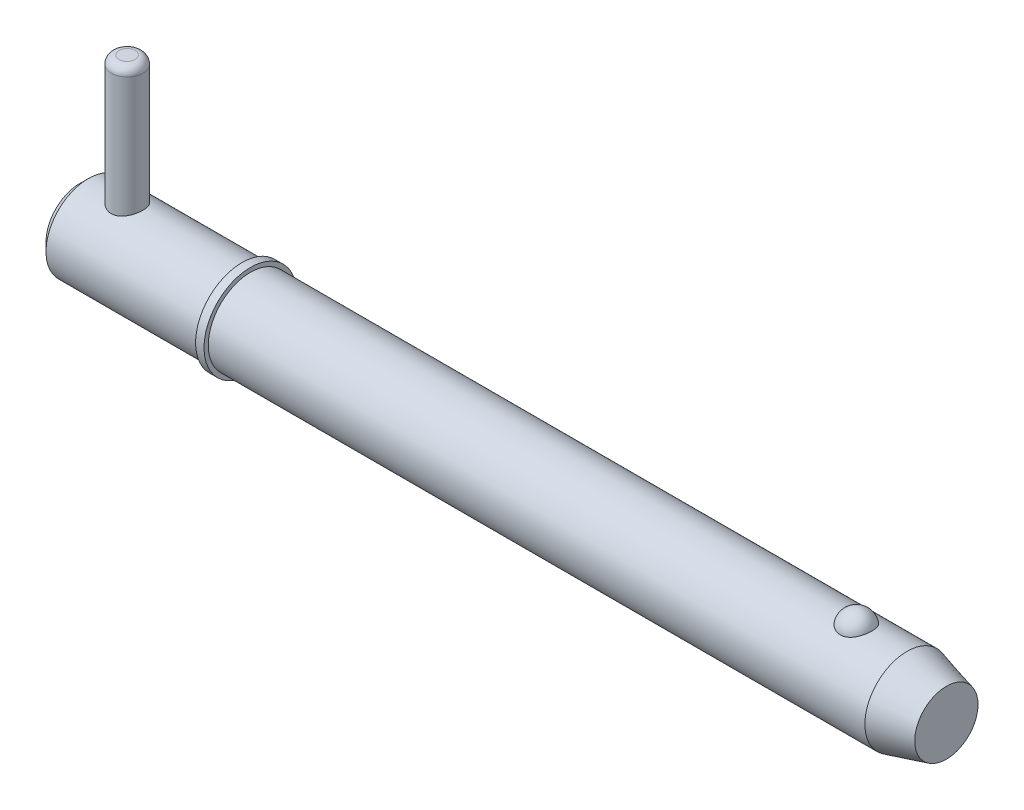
ISO-10303-21;
HEADER;
FILE_DESCRIPTION(('STEP AP214'),'2;1');
FILE_NAME('part.step','',(''),(''),'','','');
FILE_SCHEMA(('AUTOMOTIVE_DESIGN { 1 0 10303 214 1 1 1 1 }'));
ENDSEC;
DATA;
#1=APPLICATION_CONTEXT('core data for automotive mechanical design processes');
#2=APPLICATION_PROTOCOL_DEFINITION('international standard','automotive_design',2000,#1);
#3=PRODUCT_CONTEXT('',#1,'mechanical');
#4=PRODUCT('Part','Part','',(#3));
#5=PRODUCT_RELATED_PRODUCT_CATEGORY('part','',(#4));
#6=PRODUCT_DEFINITION_FORMATION('','',#4);
#7=PRODUCT_DEFINITION_CONTEXT('part definition',#1,'design');
#8=PRODUCT_DEFINITION('design','',#6,#7);
#9=PRODUCT_DEFINITION_SHAPE('','',#8);
#10=(LENGTH_UNIT() NAMED_UNIT(*) SI_UNIT(.MILLI.,.METRE.));
#11=(NAMED_UNIT(*) PLANE_ANGLE_UNIT() SI_UNIT($,.RADIAN.));
#12=(NAMED_UNIT(*) SI_UNIT($,.STERADIAN.) SOLID_ANGLE_UNIT());
#13=UNCERTAINTY_MEASURE_WITH_UNIT(LENGTH_MEASURE(1.E-05),#10,'distance_accuracy_value','');
#14=(GEOMETRIC_REPRESENTATION_CONTEXT(3) GLOBAL_UNCERTAINTY_ASSIGNED_CONTEXT((#13)) GLOBAL_UNIT_ASSIGNED_CONTEXT((#10,
#11,#12)) REPRESENTATION_CONTEXT('',''));
#15=CARTESIAN_POINT('',(0.,0.,0.));
#16=DIRECTION('',(0.,0.,1.));
#17=DIRECTION('',(1.,0.,0.));
#18=AXIS2_PLACEMENT_3D('',#15,#16,#17);
#19=CARTESIAN_POINT('',(7.14,25.4,0.));
#20=DIRECTION('',(0.,-1.,0.));
#21=DIRECTION('',(0.,0.,-1.));
#22=AXIS2_PLACEMENT_3D('',#19,#20,#21);
#23=CYLINDRICAL_SURFACE('',#22,2.38);
#24=CARTESIAN_POINT('',(7.14,-5.16,0.));
#25=DIRECTION('',(0.,1.,0.));
#26=DIRECTION('',(0.,0.,1.));
#27=AXIS2_PLACEMENT_3D('',#24,#25,#26);
#28=CIRCLE('',#27,2.38);
#29=CARTESIAN_POINT('',(7.14,-5.16,2.38));
#30=VERTEX_POINT('',#29);
#31=EDGE_CURVE('P0_E24',#30,#30,#28,.T.);
#32=ORIENTED_EDGE('',*,*,#31,.T.);
#33=EDGE_LOOP('',(#32));
#34=FACE_BOUND('',#33,.T.);
#35=CARTESIAN_POINT('',(7.14,24.21,0.));
#36=DIRECTION('',(0.,1.,0.));
#37=DIRECTION('',(0.,0.,1.));
#38=AXIS2_PLACEMENT_3D('',#35,#36,#37);
#39=CIRCLE('',#38,2.38);
#40=CARTESIAN_POINT('',(7.14,24.21,2.38));
#41=VERTEX_POINT('',#40);
#42=EDGE_CURVE('P0_E28',#41,#41,#39,.F.);
#43=ORIENTED_EDGE('',*,*,#42,.T.);
#44=EDGE_LOOP('',(#43));
#45=FACE_BOUND('',#44,.T.);
#46=ADVANCED_FACE('P0_F13',(#34,#45),#23,.T.);
#47=CARTESIAN_POINT('',(7.14,25.4,0.));
#48=DIRECTION('',(0.,1.,0.));
#49=DIRECTION('',(0.,0.,1.));
#50=AXIS2_PLACEMENT_3D('',#47,#48,#49);
#51=PLANE('',#50);
#52=CARTESIAN_POINT('',(7.14,25.4,0.));
#53=DIRECTION('',(0.,1.,0.));
#54=DIRECTION('',(0.,0.,1.));
#55=AXIS2_PLACEMENT_3D('',#52,#53,#54);
#56=CIRCLE('',#55,1.19);
#57=CARTESIAN_POINT('',(7.14,25.4,1.19));
#58=VERTEX_POINT('',#57);
#59=EDGE_CURVE('P0_E9',#58,#58,#56,.T.);
#60=ORIENTED_EDGE('',*,*,#59,.T.);
#61=EDGE_LOOP('',(#60));
#62=FACE_BOUND('',#61,.T.);
#63=ADVANCED_FACE('P0_F45',(#62),#51,.T.);
#64=CARTESIAN_POINT('',(7.14,-6.35,0.));
#65=DIRECTION('',(0.,1.,0.));
#66=DIRECTION('',(0.,0.,1.));
#67=AXIS2_PLACEMENT_3D('',#64,#65,#66);
#68=PLANE('',#67);
#69=CARTESIAN_POINT('',(7.14,-6.35,0.));
#70=DIRECTION('',(0.,1.,0.));
#71=DIRECTION('',(0.,0.,1.));
#72=AXIS2_PLACEMENT_3D('',#69,#70,#71);
#73=CIRCLE('',#72,1.19);
#74=CARTESIAN_POINT('',(7.14,-6.35,1.19));
#75=VERTEX_POINT('',#74);
#76=EDGE_CURVE('P0_E20',#75,#75,#73,.F.);
#77=ORIENTED_EDGE('',*,*,#76,.T.);
#78=EDGE_LOOP('',(#77));
#79=FACE_BOUND('',#78,.T.);
#80=ADVANCED_FACE('P0_F42',(#79),#68,.F.);
#81=CARTESIAN_POINT('',(7.14,-5.16,0.));
#82=DIRECTION('',(0.,1.,0.));
#83=DIRECTION('',(0.,0.,1.));
#84=AXIS2_PLACEMENT_3D('',#81,#82,#83);
#85=DEGENERATE_TOROIDAL_SURFACE('',#84,1.19,1.19,.T.);
#86=ORIENTED_EDGE('',*,*,#76,.F.);
#87=EDGE_LOOP('',(#86));
#88=FACE_BOUND('',#87,.T.);
#89=ORIENTED_EDGE('',*,*,#31,.F.);
#90=EDGE_LOOP('',(#89));
#91=FACE_BOUND('',#90,.T.);
#92=ADVANCED_FACE('P0_F37',(#88,#91),#85,.T.);
#93=CARTESIAN_POINT('',(7.14,24.21,0.));
#94=DIRECTION('',(0.,1.,0.));
#95=DIRECTION('',(0.,0.,1.));
#96=AXIS2_PLACEMENT_3D('',#93,#94,#95);
#97=DEGENERATE_TOROIDAL_SURFACE('',#96,1.19,1.19,.T.);
#98=ORIENTED_EDGE('',*,*,#42,.F.);
#99=EDGE_LOOP('',(#98));
#100=FACE_BOUND('',#99,.T.);
#101=ORIENTED_EDGE('',*,*,#59,.F.);
#102=EDGE_LOOP('',(#101));
#103=FACE_BOUND('',#102,.T.);
#104=ADVANCED_FACE('P0_F15',(#100,#103),#97,.T.);
#105=CLOSED_SHELL('',(#46,#63,#80,#92,#104));
#106=MANIFOLD_SOLID_BREP('P0_B1',#105);
#107=CARTESIAN_POINT('',(0.,0.,0.));
#108=DIRECTION('',(1.,0.,0.));
#109=DIRECTION('',(0.,0.,-1.));
#110=AXIS2_PLACEMENT_3D('',#107,#108,#109);
#111=CYLINDRICAL_SURFACE('',#110,6.35);
#112=CARTESIAN_POINT('',(124.555369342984,0.,0.));
#113=DIRECTION('',(1.,0.,0.));
#114=DIRECTION('',(0.,0.,-1.));
#115=AXIS2_PLACEMENT_3D('',#112,#113,#114);
#116=CIRCLE('',#115,6.35);
#117=CARTESIAN_POINT('',(124.555369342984,0.,-6.35));
#118=VERTEX_POINT('',#117);
#119=EDGE_CURVE('P1_E81',#118,#118,#116,.T.);
#120=ORIENTED_EDGE('',*,*,#119,.F.);
#121=EDGE_LOOP('',(#120));
#122=FACE_BOUND('',#121,.T.);
#123=CARTESIAN_POINT('',(25.7,0.,0.));
#124=DIRECTION('',(1.,0.,0.));
#125=DIRECTION('',(0.,0.,-1.));
#126=AXIS2_PLACEMENT_3D('',#123,#124,#125);
#127=CIRCLE('',#126,6.35);
#128=CARTESIAN_POINT('',(25.7,0.,-6.35));
#129=VERTEX_POINT('',#128);
#130=EDGE_CURVE('P1_E85',#129,#129,#127,.T.);
#131=ORIENTED_EDGE('',*,*,#130,.T.);
#132=EDGE_LOOP('',(#131));
#133=FACE_BOUND('',#132,.T.);
#134=CARTESIAN_POINT('',(116.930021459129,5.87502187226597,2.40969251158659));
#135=CARTESIAN_POINT('',(116.805030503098,5.87501645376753,2.40969773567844));
#136=CARTESIAN_POINT('',(116.680080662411,5.87916061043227,2.39967292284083));
#137=CARTESIAN_POINT('',(116.433909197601,5.8952311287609,2.35991730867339));
#138=CARTESIAN_POINT('',(116.312686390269,5.90715499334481,2.33019283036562));
#139=CARTESIAN_POINT('',(116.077517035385,5.93739567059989,2.25201402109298));
#140=CARTESIAN_POINT('',(115.963560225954,5.95570321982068,2.2035868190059));
#141=CARTESIAN_POINT('',(115.74557352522,5.99672067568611,2.08937987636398));
#142=CARTESIAN_POINT('',(115.641545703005,6.01943149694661,2.02359652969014));
#143=CARTESIAN_POINT('',(115.442943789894,6.06760647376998,1.87428969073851));
#144=CARTESIAN_POINT('',(115.348726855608,6.09313095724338,1.79031110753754));
#145=CARTESIAN_POINT('',(115.175255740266,6.14375873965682,1.60800178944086));
#146=CARTESIAN_POINT('',(115.096004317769,6.16886196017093,1.50966841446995));
#147=CARTESIAN_POINT('',(114.950845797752,6.21724600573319,1.29645884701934));
#148=CARTESIAN_POINT('',(114.885688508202,6.24039621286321,1.18104158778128));
#149=CARTESIAN_POINT('',(114.774703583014,6.28117277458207,0.940351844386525));
#150=CARTESIAN_POINT('',(114.728877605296,6.29879865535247,0.815078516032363));
#151=CARTESIAN_POINT('',(114.657023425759,6.32692073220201,0.556494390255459));
#152=CARTESIAN_POINT('',(114.631249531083,6.33732517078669,0.423102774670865));
#153=CARTESIAN_POINT('',(114.600988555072,6.34957673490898,0.153542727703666));
#154=CARTESIAN_POINT('',(114.596500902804,6.35142408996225,0.0173743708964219));
#155=CARTESIAN_POINT('',(114.608865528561,6.34638925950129,-0.253036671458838));
#156=CARTESIAN_POINT('',(114.625594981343,6.33955731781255,-0.387285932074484));
#157=CARTESIAN_POINT('',(114.679843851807,6.31794129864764,-0.650851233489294));
#158=CARTESIAN_POINT('',(114.717363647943,6.30315707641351,-0.780167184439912));
#159=CARTESIAN_POINT('',(114.812500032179,6.26711642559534,-1.03041949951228));
#160=CARTESIAN_POINT('',(114.870143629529,6.24585130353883,-1.15134433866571));
#161=CARTESIAN_POINT('',(115.004352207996,6.19905619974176,-1.38129800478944));
#162=CARTESIAN_POINT('',(115.080918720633,6.17352587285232,-1.49032586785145));
#163=CARTESIAN_POINT('',(115.251753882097,6.12080227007,-1.69393164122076));
#164=CARTESIAN_POINT('',(115.346100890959,6.09360200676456,-1.78844209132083));
#165=CARTESIAN_POINT('',(115.550119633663,6.04070434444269,-1.95970536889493));
#166=CARTESIAN_POINT('',(115.659790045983,6.01500681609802,-2.03645972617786));
#167=CARTESIAN_POINT('',(115.889187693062,5.96867714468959,-2.1684564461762));
#168=CARTESIAN_POINT('',(116.008652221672,5.94794910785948,-2.22412062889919));
#169=CARTESIAN_POINT('',(116.256218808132,5.91340580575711,-2.31440992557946));
#170=CARTESIAN_POINT('',(116.384317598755,5.89958794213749,-2.3490429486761));
#171=CARTESIAN_POINT('',(116.638582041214,5.88111049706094,-2.39491590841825));
#172=CARTESIAN_POINT('',(116.764520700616,5.876025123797,-2.40724512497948));
#173=CARTESIAN_POINT('',(117.016786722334,5.87428980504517,-2.41147867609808));
#174=CARTESIAN_POINT('',(117.143114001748,5.87763817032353,-2.40338710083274));
#175=CARTESIAN_POINT('',(117.388417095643,5.89212921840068,-2.36762715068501));
#176=CARTESIAN_POINT('',(117.507499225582,5.90302431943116,-2.34058030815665));
#177=CARTESIAN_POINT('',(117.73924472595,5.93113752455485,-2.26839066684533));
#178=CARTESIAN_POINT('',(117.851907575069,5.94835614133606,-2.2232464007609));
#179=CARTESIAN_POINT('',(118.070400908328,5.98773016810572,-2.11493806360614));
#180=CARTESIAN_POINT('',(118.176028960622,6.00998499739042,-2.05140269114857));
#181=CARTESIAN_POINT('',(118.375300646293,6.05690144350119,-1.90842705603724));
#182=CARTESIAN_POINT('',(118.468941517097,6.08156361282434,-1.82898313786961));
#183=CARTESIAN_POINT('',(118.646675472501,6.13211715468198,-1.65182429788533));
#184=CARTESIAN_POINT('',(118.730055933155,6.15800825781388,-1.55339381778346));
#185=CARTESIAN_POINT('',(118.879790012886,6.20712834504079,-1.34374214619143));
#186=CARTESIAN_POINT('',(118.946140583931,6.23035685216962,-1.23251867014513));
#187=CARTESIAN_POINT('',(119.062345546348,6.27251177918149,-0.996447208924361));
#188=CARTESIAN_POINT('',(119.111607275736,6.29127762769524,-0.871278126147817));
#189=CARTESIAN_POINT('',(119.189614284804,6.3215862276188,-0.613870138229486));
#190=CARTESIAN_POINT('',(119.218359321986,6.33312889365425,-0.481631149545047));
#191=CARTESIAN_POINT('',(119.25477058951,6.34782349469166,-0.213672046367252));
#192=CARTESIAN_POINT('',(119.262413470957,6.35096613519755,-0.0779482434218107));
#193=CARTESIAN_POINT('',(119.256395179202,6.34851322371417,0.19294395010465));
#194=CARTESIAN_POINT('',(119.242734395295,6.3429178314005,0.32811235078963));
#195=CARTESIAN_POINT('',(119.19450361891,6.32360512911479,0.593406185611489));
#196=CARTESIAN_POINT('',(119.160031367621,6.30992579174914,0.723552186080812));
#197=CARTESIAN_POINT('',(119.070953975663,6.27586325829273,0.975834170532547));
#198=CARTESIAN_POINT('',(119.01634761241,6.25547965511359,1.09796966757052));
#199=CARTESIAN_POINT('',(118.88775879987,6.20998183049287,1.33148921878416));
#200=CARTESIAN_POINT('',(118.813674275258,6.18484288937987,1.44281227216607));
#201=CARTESIAN_POINT('',(118.647820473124,6.13258735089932,1.65087683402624));
#202=CARTESIAN_POINT('',(118.556051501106,6.10547078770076,1.74761859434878));
#203=CARTESIAN_POINT('',(118.357183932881,6.0523587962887,1.92350926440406));
#204=CARTESIAN_POINT('',(118.250133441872,6.0263601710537,2.00271146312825));
#205=CARTESIAN_POINT('',(118.023138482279,5.97843747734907,2.14154159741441));
#206=CARTESIAN_POINT('',(117.903191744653,5.95651412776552,2.20116608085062));
#207=CARTESIAN_POINT('',(117.644523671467,5.91812106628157,2.30250570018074));
#208=CARTESIAN_POINT('',(117.50506980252,5.90217533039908,2.34256795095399));
#209=CARTESIAN_POINT('',(117.220397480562,5.88063128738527,2.39615214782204));
#210=CARTESIAN_POINT('',(117.07518174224,5.8750281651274,2.40968644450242));
#211=CARTESIAN_POINT('',(116.930021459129,5.87502187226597,2.40969251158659));
#212=B_SPLINE_CURVE_WITH_KNOTS('',3,(#134,#135,#136,#137,#138,#139,#140,#141,#142,#143,#144,
#145,#146,#147,#148,#149,#150,#151,#152,#153,#154,#155,#156,#157,#158,#159,#160,#161,#162,#163,
#164,#165,#166,#167,#168,#169,#170,#171,#172,#173,#174,#175,#176,#177,#178,#179,#180,#181,#182,
#183,#184,#185,#186,#187,#188,#189,#190,#191,#192,#193,#194,#195,#196,#197,#198,#199,#200,#201,
#202,#203,#204,#205,#206,#207,#208,#209,#210,#211),.UNSPECIFIED.,.T.,.F.,(4,2,2,2,2,2,2,2,2,2,2,
2,2,2,2,2,2,2,2,2,2,2,2,2,2,2,2,2,2,2,2,2,2,2,2,2,2,2,4),(0.,0.374440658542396,
0.748761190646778,1.12254078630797,1.49639810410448,1.88098871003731,2.26565013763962,
2.66741104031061,3.06920639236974,3.47601794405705,3.88281858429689,4.28727498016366,
4.69173873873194,5.09674745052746,5.50178895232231,5.90865911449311,6.31549420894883,
6.71369855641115,7.11175305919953,7.48978077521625,7.86773278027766,8.2338388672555,
8.59997464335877,8.97409044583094,9.34829231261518,9.74122667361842,10.1342313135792,
10.5397522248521,10.9452779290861,11.3512521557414,11.7572189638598,12.1612938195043,
12.5653932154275,12.9716540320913,13.3779078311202,13.7829098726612,14.1879832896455,
14.6230486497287,15.0579114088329),.UNSPECIFIED.);
#213=CARTESIAN_POINT('',(116.930021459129,5.87502187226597,2.40969251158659));
#214=VERTEX_POINT('',#213);
#215=EDGE_CURVE('P1_E35',#214,#214,#212,.T.);
#216=ORIENTED_EDGE('',*,*,#215,.T.);
#217=EDGE_LOOP('',(#216));
#218=FACE_BOUND('',#217,.T.);
#219=ADVANCED_FACE('P1_F13',(#122,#133,#218),#111,.T.);
#220=CARTESIAN_POINT('',(0.,0.,0.));
#221=DIRECTION('',(-1.,0.,0.));
#222=DIRECTION('',(0.,0.,1.));
#223=AXIS2_PLACEMENT_3D('',#220,#221,#222);
#224=PLANE('',#223);
#225=CARTESIAN_POINT('',(0.,0.,0.));
#226=DIRECTION('',(1.,0.,0.));
#227=DIRECTION('',(0.,0.,-1.));
#228=AXIS2_PLACEMENT_3D('',#225,#226,#227);
#229=CIRCLE('',#228,5.08);
#230=CARTESIAN_POINT('',(0.,0.,-5.08));
#231=VERTEX_POINT('',#230);
#232=EDGE_CURVE('P1_E9',#231,#231,#229,.T.);
#233=ORIENTED_EDGE('',*,*,#232,.F.);
#234=EDGE_LOOP('',(#233));
#235=FACE_BOUND('',#234,.T.);
#236=ADVANCED_FACE('P1_F15',(#235),#224,.T.);
#237=CARTESIAN_POINT('',(1.27,0.,0.));
#238=DIRECTION('',(1.,0.,0.));
#239=DIRECTION('',(0.,0.,-1.));
#240=AXIS2_PLACEMENT_3D('',#237,#238,#239);
#241=CONICAL_SURFACE('',#240,6.35,0.78539816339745);
#242=ORIENTED_EDGE('',*,*,#232,.T.);
#243=EDGE_LOOP('',(#242));
#244=FACE_BOUND('',#243,.T.);
#245=CARTESIAN_POINT('',(1.27,0.,0.));
#246=DIRECTION('',(1.,0.,0.));
#247=DIRECTION('',(0.,0.,-1.));
#248=AXIS2_PLACEMENT_3D('',#245,#246,#247);
#249=CIRCLE('',#248,6.35);
#250=CARTESIAN_POINT('',(1.27,0.,-6.35));
#251=VERTEX_POINT('',#250);
#252=EDGE_CURVE('P1_E26',#251,#251,#249,.T.);
#253=ORIENTED_EDGE('',*,*,#252,.F.);
#254=EDGE_LOOP('',(#253));
#255=FACE_BOUND('',#254,.T.);
#256=ADVANCED_FACE('P1_F77',(#244,#255),#241,.T.);
#257=CARTESIAN_POINT('',(0.,0.,0.));
#258=DIRECTION('',(1.,0.,0.));
#259=DIRECTION('',(0.,0.,-1.));
#260=AXIS2_PLACEMENT_3D('',#257,#258,#259);
#261=CYLINDRICAL_SURFACE('',#260,6.35);
#262=CARTESIAN_POINT('',(7.14,-5.88711304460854,2.38));
#263=CARTESIAN_POINT('',(7.01146258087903,-5.88710856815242,2.38000480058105));
#264=CARTESIAN_POINT('',(6.88295682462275,-5.89136840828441,2.36955244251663));
#265=CARTESIAN_POINT('',(6.62981934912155,-5.90782785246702,2.32820953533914));
#266=CARTESIAN_POINT('',(6.50518751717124,-5.92002722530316,2.29731958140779));
#267=CARTESIAN_POINT('',(6.26352403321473,-5.95079384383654,2.21639366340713));
#268=CARTESIAN_POINT('',(6.14647496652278,-5.96934583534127,2.16640353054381));
#269=CARTESIAN_POINT('',(5.92237941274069,-6.01070278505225,2.04885862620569));
#270=CARTESIAN_POINT('',(5.81533593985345,-6.03350901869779,1.98129858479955));
#271=CARTESIAN_POINT('',(5.60897525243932,-6.08207341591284,1.82693902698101));
#272=CARTESIAN_POINT('',(5.51022503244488,-6.10791836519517,1.73940861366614));
#273=CARTESIAN_POINT('',(5.32840561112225,-6.15892405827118,1.54914379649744));
#274=CARTESIAN_POINT('',(5.24533975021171,-6.1840846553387,1.44640616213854));
#275=CARTESIAN_POINT('',(5.09451639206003,-6.23191821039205,1.22434014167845));
#276=CARTESIAN_POINT('',(5.02737511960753,-6.25447755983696,1.10456656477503));
#277=CARTESIAN_POINT('',(4.91443001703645,-6.2935236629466,0.854429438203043));
#278=CARTESIAN_POINT('',(4.86861879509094,-6.31001251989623,0.724069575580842));
#279=CARTESIAN_POINT('',(4.80162253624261,-6.33444370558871,0.46242122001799));
#280=CARTESIAN_POINT('',(4.77946137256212,-6.34272370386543,0.331414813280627));
#281=CARTESIAN_POINT('',(4.75726677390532,-6.35101600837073,0.0672982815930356));
#282=CARTESIAN_POINT('',(4.75722615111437,-6.35103100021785,-0.0658111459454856));
#283=CARTESIAN_POINT('',(4.77870510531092,-6.3430064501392,-0.323358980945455));
#284=CARTESIAN_POINT('',(4.79915922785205,-6.33536494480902,-0.447900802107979));
#285=CARTESIAN_POINT('',(4.85925493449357,-6.31340794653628,-0.69163609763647));
#286=CARTESIAN_POINT('',(4.89889787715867,-6.29909198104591,-0.810829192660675));
#287=CARTESIAN_POINT('',(4.9967414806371,-6.26494471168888,-1.04254212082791));
#288=CARTESIAN_POINT('',(5.05520370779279,-6.24503620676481,-1.1549396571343));
#289=CARTESIAN_POINT('',(5.1887948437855,-6.20171869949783,-1.3686079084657));
#290=CARTESIAN_POINT('',(5.26392912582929,-6.17830856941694,-1.46987502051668));
#291=CARTESIAN_POINT('',(5.43386591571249,-6.12878580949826,-1.66468415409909));
#292=CARTESIAN_POINT('',(5.52956139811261,-6.10259519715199,-1.75742857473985));
#293=CARTESIAN_POINT('',(5.73530435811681,-6.05155777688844,-1.92585331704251));
#294=CARTESIAN_POINT('',(5.84535542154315,-6.02671130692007,-2.00152936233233));
#295=CARTESIAN_POINT('',(6.07982989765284,-5.98068420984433,-2.13519109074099));
#296=CARTESIAN_POINT('',(6.20451768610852,-5.95959698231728,-2.19274775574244));
#297=CARTESIAN_POINT('',(6.4628145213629,-5.92455622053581,-2.28574558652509));
#298=CARTESIAN_POINT('',(6.59641856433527,-5.91059872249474,-2.32119904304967));
#299=CARTESIAN_POINT('',(6.86087441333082,-5.8923327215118,-2.36717069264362));
#300=CARTESIAN_POINT('',(6.99147192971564,-5.8875347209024,-2.37895573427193));
#301=CARTESIAN_POINT('',(7.25283805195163,-5.88674545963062,-2.38091046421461));
#302=CARTESIAN_POINT('',(7.38360660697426,-5.89075200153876,-2.37108554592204));
#303=CARTESIAN_POINT('',(7.63510696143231,-5.90662331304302,-2.33124781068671));
#304=CARTESIAN_POINT('',(7.75602069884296,-5.91810660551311,-2.30221396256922));
#305=CARTESIAN_POINT('',(7.99120505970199,-5.94718527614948,-2.22601401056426));
#306=CARTESIAN_POINT('',(8.10547431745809,-5.96478190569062,-2.17884419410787));
#307=CARTESIAN_POINT('',(8.32888632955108,-6.00491533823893,-2.06572311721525));
#308=CARTESIAN_POINT('',(8.43767672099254,-6.02761250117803,-1.99913452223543));
#309=CARTESIAN_POINT('',(8.6429894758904,-6.07511988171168,-1.84974438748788));
#310=CARTESIAN_POINT('',(8.73950733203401,-6.09993087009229,-1.76693691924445));
#311=CARTESIAN_POINT('',(8.9238741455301,-6.1507686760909,-1.58125563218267));
#312=CARTESIAN_POINT('',(9.01078732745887,-6.17677301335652,-1.47744327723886));
#313=CARTESIAN_POINT('',(9.16607127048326,-6.22556172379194,-1.25606967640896));
#314=CARTESIAN_POINT('',(9.23444197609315,-6.24834608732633,-1.13850838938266));
#315=CARTESIAN_POINT('',(9.3502493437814,-6.28811144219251,-0.893050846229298));
#316=CARTESIAN_POINT('',(9.39775808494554,-6.30511236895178,-0.765192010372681));
#317=CARTESIAN_POINT('',(9.47032640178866,-6.33145833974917,-0.502514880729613));
#318=CARTESIAN_POINT('',(9.49539651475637,-6.34080697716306,-0.367699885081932));
#319=CARTESIAN_POINT('',(9.52124059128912,-6.35045496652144,-0.103396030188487));
#320=CARTESIAN_POINT('',(9.52334421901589,-6.35124952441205,0.0259458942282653));
#321=CARTESIAN_POINT('',(9.50661518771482,-6.34499064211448,0.283061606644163));
#322=CARTESIAN_POINT('',(9.48778504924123,-6.33793814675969,0.410835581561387));
#323=CARTESIAN_POINT('',(9.43065630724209,-6.31700307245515,0.658028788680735));
#324=CARTESIAN_POINT('',(9.39284291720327,-6.30329098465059,0.777575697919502));
#325=CARTESIAN_POINT('',(9.29930406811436,-6.27046903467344,1.00863789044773));
#326=CARTESIAN_POINT('',(9.2435752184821,-6.25135815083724,1.12015164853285));
#327=CARTESIAN_POINT('',(9.11312349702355,-6.20865254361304,1.33711407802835));
#328=CARTESIAN_POINT('',(9.03770094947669,-6.18490316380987,1.44211105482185));
#329=CARTESIAN_POINT('',(8.87110640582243,-6.13583718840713,1.63836897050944));
#330=CARTESIAN_POINT('',(8.77992879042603,-6.11052003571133,1.72962498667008));
#331=CARTESIAN_POINT('',(8.57869799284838,-6.05953829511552,1.90076098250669));
#332=CARTESIAN_POINT('',(8.46790320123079,-6.03392573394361,1.97978778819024));
#333=CARTESIAN_POINT('',(8.23379693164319,-5.98676607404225,2.11813466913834));
#334=CARTESIAN_POINT('',(8.11048418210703,-5.9652193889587,2.17745273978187));
#335=CARTESIAN_POINT('',(7.84900037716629,-5.92818393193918,2.27641807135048));
#336=CARTESIAN_POINT('',(7.71041678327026,-5.91299857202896,2.31510015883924));
#337=CARTESIAN_POINT('',(7.42787316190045,-5.89246887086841,2.36688002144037));
#338=CARTESIAN_POINT('',(7.28391673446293,-5.88711805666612,2.37999462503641));
#339=CARTESIAN_POINT('',(7.14,-5.88711304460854,2.38));
#340=B_SPLINE_CURVE_WITH_KNOTS('',3,(#262,#263,#264,#265,#266,#267,#268,#269,#270,#271,#272,
#273,#274,#275,#276,#277,#278,#279,#280,#281,#282,#283,#284,#285,#286,#287,#288,#289,#290,#291,
#292,#293,#294,#295,#296,#297,#298,#299,#300,#301,#302,#303,#304,#305,#306,#307,#308,#309,#310,
#311,#312,#313,#314,#315,#316,#317,#318,#319,#320,#321,#322,#323,#324,#325,#326,#327,#328,#329,
#330,#331,#332,#333,#334,#335,#336,#337,#338,#339),.UNSPECIFIED.,.T.,.F.,(4,2,2,2,2,2,2,2,2,2,2,
2,2,2,2,2,2,2,2,2,2,2,2,2,2,2,2,2,2,2,2,2,2,2,2,2,2,2,4),(0.,0.385076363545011,
0.770141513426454,1.15428843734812,1.53855071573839,1.94016118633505,2.3418570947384,
2.75720522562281,3.1724093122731,3.569721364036,3.96690431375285,4.34445758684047,
4.72203759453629,5.10511017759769,5.48830640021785,5.89390240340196,6.29959991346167,
6.71428455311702,7.12873839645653,7.52034494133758,7.91185376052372,8.28480528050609,
8.65783318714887,9.0448340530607,9.43197664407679,9.84363087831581,10.2552863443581,
10.6655081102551,11.0755371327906,11.4616919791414,11.847800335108,12.224507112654,
12.6012852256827,12.9938941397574,13.386643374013,13.8000944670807,14.2135876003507,
14.6450218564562,15.0761720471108),.UNSPECIFIED.);
#341=CARTESIAN_POINT('',(7.14,-5.88711304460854,2.38));
#342=VERTEX_POINT('',#341);
#343=EDGE_CURVE('P1_E17',#342,#342,#340,.T.);
#344=ORIENTED_EDGE('',*,*,#343,.F.);
#345=EDGE_LOOP('',(#344));
#346=FACE_BOUND('',#345,.T.);
#347=CARTESIAN_POINT('',(7.14,5.88711304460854,2.38));
#348=CARTESIAN_POINT('',(7.26853741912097,5.88710856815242,2.38000480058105));
#349=CARTESIAN_POINT('',(7.39704317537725,5.89136840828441,2.36955244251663));
#350=CARTESIAN_POINT('',(7.65018065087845,5.90782785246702,2.32820953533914));
#351=CARTESIAN_POINT('',(7.77481248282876,5.92002722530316,2.29731958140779));
#352=CARTESIAN_POINT('',(8.01647596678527,5.95079384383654,2.21639366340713));
#353=CARTESIAN_POINT('',(8.13352503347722,5.96934583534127,2.16640353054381));
#354=CARTESIAN_POINT('',(8.35762058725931,6.01070278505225,2.04885862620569));
#355=CARTESIAN_POINT('',(8.46466406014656,6.03350901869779,1.98129858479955));
#356=CARTESIAN_POINT('',(8.67102474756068,6.08207341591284,1.82693902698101));
#357=CARTESIAN_POINT('',(8.76977496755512,6.10791836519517,1.73940861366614));
#358=CARTESIAN_POINT('',(8.95159438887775,6.15892405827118,1.54914379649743));
#359=CARTESIAN_POINT('',(9.03466024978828,6.1840846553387,1.44640616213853));
#360=CARTESIAN_POINT('',(9.18548360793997,6.23191821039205,1.22434014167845));
#361=CARTESIAN_POINT('',(9.25262488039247,6.25447755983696,1.10456656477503));
#362=CARTESIAN_POINT('',(9.36556998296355,6.2935236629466,0.854429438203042));
#363=CARTESIAN_POINT('',(9.41138120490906,6.31001251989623,0.72406957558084));
#364=CARTESIAN_POINT('',(9.47837746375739,6.33444370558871,0.462421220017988));
#365=CARTESIAN_POINT('',(9.50053862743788,6.34272370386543,0.331414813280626));
#366=CARTESIAN_POINT('',(9.52273322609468,6.35101600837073,0.067298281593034));
#367=CARTESIAN_POINT('',(9.52277384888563,6.35103100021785,-0.0658111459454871));
#368=CARTESIAN_POINT('',(9.50129489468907,6.3430064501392,-0.323358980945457));
#369=CARTESIAN_POINT('',(9.48084077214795,6.33536494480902,-0.447900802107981));
#370=CARTESIAN_POINT('',(9.42074506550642,6.31340794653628,-0.691636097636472));
#371=CARTESIAN_POINT('',(9.38110212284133,6.29909198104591,-0.810829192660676));
#372=CARTESIAN_POINT('',(9.2832585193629,6.26494471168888,-1.04254212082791));
#373=CARTESIAN_POINT('',(9.22479629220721,6.24503620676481,-1.1549396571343));
#374=CARTESIAN_POINT('',(9.0912051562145,6.20171869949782,-1.3686079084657));
#375=CARTESIAN_POINT('',(9.0160708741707,6.17830856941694,-1.46987502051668));
#376=CARTESIAN_POINT('',(8.84613408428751,6.12878580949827,-1.66468415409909));
#377=CARTESIAN_POINT('',(8.75043860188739,6.10259519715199,-1.75742857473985));
#378=CARTESIAN_POINT('',(8.54469564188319,6.05155777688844,-1.92585331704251));
#379=CARTESIAN_POINT('',(8.43464457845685,6.02671130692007,-2.00152936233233));
#380=CARTESIAN_POINT('',(8.20017010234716,5.98068420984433,-2.13519109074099));
#381=CARTESIAN_POINT('',(8.07548231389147,5.95959698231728,-2.19274775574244));
#382=CARTESIAN_POINT('',(7.8171854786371,5.92455622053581,-2.28574558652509));
#383=CARTESIAN_POINT('',(7.68358143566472,5.91059872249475,-2.32119904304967));
#384=CARTESIAN_POINT('',(7.41912558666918,5.8923327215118,-2.36717069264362));
#385=CARTESIAN_POINT('',(7.28852807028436,5.8875347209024,-2.37895573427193));
#386=CARTESIAN_POINT('',(7.02716194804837,5.88674545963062,-2.38091046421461));
#387=CARTESIAN_POINT('',(6.89639339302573,5.89075200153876,-2.37108554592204));
#388=CARTESIAN_POINT('',(6.64489303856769,5.90662331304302,-2.33124781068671));
#389=CARTESIAN_POINT('',(6.52397930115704,5.91810660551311,-2.30221396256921));
#390=CARTESIAN_POINT('',(6.288794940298,5.94718527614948,-2.22601401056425));
#391=CARTESIAN_POINT('',(6.17452568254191,5.96478190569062,-2.17884419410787));
#392=CARTESIAN_POINT('',(5.95111367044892,6.00491533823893,-2.06572311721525));
#393=CARTESIAN_POINT('',(5.84232327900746,6.02761250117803,-1.99913452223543));
#394=CARTESIAN_POINT('',(5.6370105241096,6.07511988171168,-1.84974438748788));
#395=CARTESIAN_POINT('',(5.54049266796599,6.09993087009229,-1.76693691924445));
#396=CARTESIAN_POINT('',(5.3561258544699,6.1507686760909,-1.58125563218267));
#397=CARTESIAN_POINT('',(5.26921267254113,6.17677301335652,-1.47744327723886));
#398=CARTESIAN_POINT('',(5.11392872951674,6.22556172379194,-1.25606967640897));
#399=CARTESIAN_POINT('',(5.04555802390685,6.24834608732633,-1.13850838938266));
#400=CARTESIAN_POINT('',(4.9297506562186,6.28811144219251,-0.893050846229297));
#401=CARTESIAN_POINT('',(4.88224191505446,6.30511236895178,-0.765192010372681));
#402=CARTESIAN_POINT('',(4.80967359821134,6.33145833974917,-0.502514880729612));
#403=CARTESIAN_POINT('',(4.78460348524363,6.34080697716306,-0.367699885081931));
#404=CARTESIAN_POINT('',(4.75875940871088,6.35045496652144,-0.103396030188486));
#405=CARTESIAN_POINT('',(4.75665578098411,6.35124952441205,0.0259458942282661));
#406=CARTESIAN_POINT('',(4.77338481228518,6.34499064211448,0.283061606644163));
#407=CARTESIAN_POINT('',(4.79221495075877,6.33793814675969,0.410835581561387));
#408=CARTESIAN_POINT('',(4.84934369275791,6.31700307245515,0.658028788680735));
#409=CARTESIAN_POINT('',(4.88715708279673,6.30329098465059,0.777575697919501));
#410=CARTESIAN_POINT('',(4.98069593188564,6.27046903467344,1.00863789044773));
#411=CARTESIAN_POINT('',(5.0364247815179,6.25135815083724,1.12015164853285));
#412=CARTESIAN_POINT('',(5.16687650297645,6.20865254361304,1.33711407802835));
#413=CARTESIAN_POINT('',(5.24229905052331,6.18490316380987,1.44211105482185));
#414=CARTESIAN_POINT('',(5.40889359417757,6.13583718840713,1.63836897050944));
#415=CARTESIAN_POINT('',(5.50007120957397,6.11052003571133,1.72962498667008));
#416=CARTESIAN_POINT('',(5.70130200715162,6.05953829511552,1.90076098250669));
#417=CARTESIAN_POINT('',(5.81209679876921,6.03392573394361,1.97978778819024));
#418=CARTESIAN_POINT('',(6.04620306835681,5.98676607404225,2.11813466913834));
#419=CARTESIAN_POINT('',(6.16951581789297,5.9652193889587,2.17745273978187));
#420=CARTESIAN_POINT('',(6.43099962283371,5.92818393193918,2.27641807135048));
#421=CARTESIAN_POINT('',(6.56958321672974,5.91299857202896,2.31510015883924));
#422=CARTESIAN_POINT('',(6.85212683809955,5.89246887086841,2.36688002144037));
#423=CARTESIAN_POINT('',(6.99608326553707,5.88711805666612,2.37999462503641));
#424=CARTESIAN_POINT('',(7.14,5.88711304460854,2.38));
#425=B_SPLINE_CURVE_WITH_KNOTS('',3,(#347,#348,#349,#350,#351,#352,#353,#354,#355,#356,#357,
#358,#359,#360,#361,#362,#363,#364,#365,#366,#367,#368,#369,#370,#371,#372,#373,#374,#375,#376,
#377,#378,#379,#380,#381,#382,#383,#384,#385,#386,#387,#388,#389,#390,#391,#392,#393,#394,#395,
#396,#397,#398,#399,#400,#401,#402,#403,#404,#405,#406,#407,#408,#409,#410,#411,#412,#413,#414,
#415,#416,#417,#418,#419,#420,#421,#422,#423,#424),.UNSPECIFIED.,.T.,.F.,(4,2,2,2,2,2,2,2,2,2,2,
2,2,2,2,2,2,2,2,2,2,2,2,2,2,2,2,2,2,2,2,2,2,2,2,2,2,2,4),(0.,0.385076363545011,
0.770141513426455,1.15428843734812,1.53855071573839,1.94016118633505,2.3418570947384,
2.75720522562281,3.1724093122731,3.56972136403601,3.96690431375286,4.34445758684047,
4.72203759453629,5.10511017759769,5.48830640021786,5.89390240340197,6.29959991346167,
6.71428455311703,7.12873839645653,7.52034494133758,7.91185376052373,8.2848052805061,
8.65783318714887,9.04483405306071,9.43197664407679,9.84363087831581,10.2552863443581,
10.6655081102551,11.0755371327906,11.4616919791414,11.847800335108,12.2245071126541,
12.6012852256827,12.9938941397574,13.386643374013,13.8000944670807,14.2135876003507,
14.6450218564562,15.0761720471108),.UNSPECIFIED.);
#426=CARTESIAN_POINT('',(7.14,5.88711304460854,2.38));
#427=VERTEX_POINT('',#426);
#428=EDGE_CURVE('P1_E43',#427,#427,#425,.T.);
#429=ORIENTED_EDGE('',*,*,#428,.F.);
#430=EDGE_LOOP('',(#429));
#431=FACE_BOUND('',#430,.T.);
#432=ORIENTED_EDGE('',*,*,#252,.T.);
#433=EDGE_LOOP('',(#432));
#434=FACE_BOUND('',#433,.T.);
#435=CARTESIAN_POINT('',(24.43,0.,0.));
#436=DIRECTION('',(1.,0.,0.));
#437=DIRECTION('',(0.,0.,-1.));
#438=AXIS2_PLACEMENT_3D('',#435,#436,#437);
#439=CIRCLE('',#438,6.35);
#440=CARTESIAN_POINT('',(24.43,0.,-6.35));
#441=VERTEX_POINT('',#440);
#442=EDGE_CURVE('P1_E31',#441,#441,#439,.T.);
#443=ORIENTED_EDGE('',*,*,#442,.F.);
#444=EDGE_LOOP('',(#443));
#445=FACE_BOUND('',#444,.T.);
#446=ADVANCED_FACE('P1_F103',(#346,#431,#434,#445),#261,.T.);
#447=CARTESIAN_POINT('',(24.43,6.35,0.));
#448=DIRECTION('',(-1.,0.,0.));
#449=DIRECTION('',(0.,0.,1.));
#450=AXIS2_PLACEMENT_3D('',#447,#448,#449);
#451=PLANE('',#450);
#452=ORIENTED_EDGE('',*,*,#442,.T.);
#453=EDGE_LOOP('',(#452));
#454=FACE_BOUND('',#453,.T.);
#455=CARTESIAN_POINT('',(24.43,0.,0.));
#456=DIRECTION('',(1.,0.,0.));
#457=DIRECTION('',(0.,0.,-1.));
#458=AXIS2_PLACEMENT_3D('',#455,#456,#457);
#459=CIRCLE('',#458,6.985);
#460=CARTESIAN_POINT('',(24.43,0.,-6.985));
#461=VERTEX_POINT('',#460);
#462=EDGE_CURVE('P1_E91',#461,#461,#459,.T.);
#463=ORIENTED_EDGE('',*,*,#462,.F.);
#464=EDGE_LOOP('',(#463));
#465=FACE_BOUND('',#464,.T.);
#466=ADVANCED_FACE('P1_F100',(#454,#465),#451,.T.);
#467=CARTESIAN_POINT('',(0.,0.,0.));
#468=DIRECTION('',(1.,0.,0.));
#469=DIRECTION('',(0.,0.,-1.));
#470=AXIS2_PLACEMENT_3D('',#467,#468,#469);
#471=CYLINDRICAL_SURFACE('',#470,6.985);
#472=ORIENTED_EDGE('',*,*,#462,.T.);
#473=EDGE_LOOP('',(#472));
#474=FACE_BOUND('',#473,.T.);
#475=CARTESIAN_POINT('',(25.7,0.,0.));
#476=DIRECTION('',(1.,0.,0.));
#477=DIRECTION('',(0.,0.,-1.));
#478=AXIS2_PLACEMENT_3D('',#475,#476,#477);
#479=CIRCLE('',#478,6.985);
#480=CARTESIAN_POINT('',(25.7,0.,-6.985));
#481=VERTEX_POINT('',#480);
#482=EDGE_CURVE('P1_E88',#481,#481,#479,.T.);
#483=ORIENTED_EDGE('',*,*,#482,.F.);
#484=EDGE_LOOP('',(#483));
#485=FACE_BOUND('',#484,.T.);
#486=ADVANCED_FACE('P1_F68',(#474,#485),#471,.T.);
#487=CARTESIAN_POINT('',(25.7,6.985,0.));
#488=DIRECTION('',(1.,0.,0.));
#489=DIRECTION('',(0.,0.,-1.));
#490=AXIS2_PLACEMENT_3D('',#487,#488,#489);
#491=PLANE('',#490);
#492=ORIENTED_EDGE('',*,*,#482,.T.);
#493=EDGE_LOOP('',(#492));
#494=FACE_BOUND('',#493,.T.);
#495=ORIENTED_EDGE('',*,*,#130,.F.);
#496=EDGE_LOOP('',(#495));
#497=FACE_BOUND('',#496,.T.);
#498=ADVANCED_FACE('P1_F62',(#494,#497),#491,.T.);
#499=CARTESIAN_POINT('',(130.48,0.,0.));
#500=DIRECTION('',(-1.,0.,0.));
#501=DIRECTION('',(0.,0.,1.));
#502=AXIS2_PLACEMENT_3D('',#499,#500,#501);
#503=CONICAL_SURFACE('',#502,4.76250000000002,0.26179938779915);
#504=ORIENTED_EDGE('',*,*,#119,.T.);
#505=EDGE_LOOP('',(#504));
#506=FACE_BOUND('',#505,.T.);
#507=CARTESIAN_POINT('',(130.48,0.,0.));
#508=DIRECTION('',(1.,0.,0.));
#509=DIRECTION('',(0.,0.,-1.));
#510=AXIS2_PLACEMENT_3D('',#507,#508,#509);
#511=CIRCLE('',#510,4.76250000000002);
#512=CARTESIAN_POINT('',(130.48,0.,-4.76250000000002));
#513=VERTEX_POINT('',#512);
#514=EDGE_CURVE('P1_E42',#513,#513,#511,.T.);
#515=ORIENTED_EDGE('',*,*,#514,.F.);
#516=EDGE_LOOP('',(#515));
#517=FACE_BOUND('',#516,.T.);
#518=ADVANCED_FACE('P1_F59',(#506,#517),#503,.T.);
#519=CARTESIAN_POINT('',(130.48,4.76250000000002,0.));
#520=DIRECTION('',(1.,0.,0.));
#521=DIRECTION('',(0.,0.,-1.));
#522=AXIS2_PLACEMENT_3D('',#519,#520,#521);
#523=PLANE('',#522);
#524=ORIENTED_EDGE('',*,*,#514,.T.);
#525=EDGE_LOOP('',(#524));
#526=FACE_BOUND('',#525,.T.);
#527=ADVANCED_FACE('P1_F55',(#526),#523,.T.);
#528=CARTESIAN_POINT('',(116.930021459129,5.715,0.));
#529=DIRECTION('',(-1.,0.,0.));
#530=DIRECTION('',(0.,1.,0.));
#531=AXIS2_PLACEMENT_3D('',#528,#529,#530);
#532=SPHERICAL_SURFACE('',#531,2.415);
#533=ORIENTED_EDGE('',*,*,#215,.F.);
#534=EDGE_LOOP('',(#533));
#535=FACE_BOUND('',#534,.T.);
#536=ADVANCED_FACE('P1_F50',(#535),#532,.T.);
#537=CARTESIAN_POINT('',(7.14,-6.985,0.));
#538=DIRECTION('',(0.,1.,0.));
#539=DIRECTION('',(0.,0.,1.));
#540=AXIS2_PLACEMENT_3D('',#537,#538,#539);
#541=CYLINDRICAL_SURFACE('',#540,2.38);
#542=ORIENTED_EDGE('',*,*,#343,.T.);
#543=EDGE_LOOP('',(#542));
#544=FACE_BOUND('',#543,.T.);
#545=ORIENTED_EDGE('',*,*,#428,.T.);
#546=EDGE_LOOP('',(#545));
#547=FACE_BOUND('',#546,.T.);
#548=ADVANCED_FACE('P1_F54',(#544,#547),#541,.F.);
#549=CLOSED_SHELL('',(#219,#236,#256,#446,#466,#486,#498,#518,#527,#536,#548));
#550=MANIFOLD_SOLID_BREP('P1_B1',#549);
#551=ADVANCED_BREP_SHAPE_REPRESENTATION('',(#18,#106,#550),#14);
#552=SHAPE_DEFINITION_REPRESENTATION(#9,#551);
ENDSEC;
END-ISO-10303-21;
